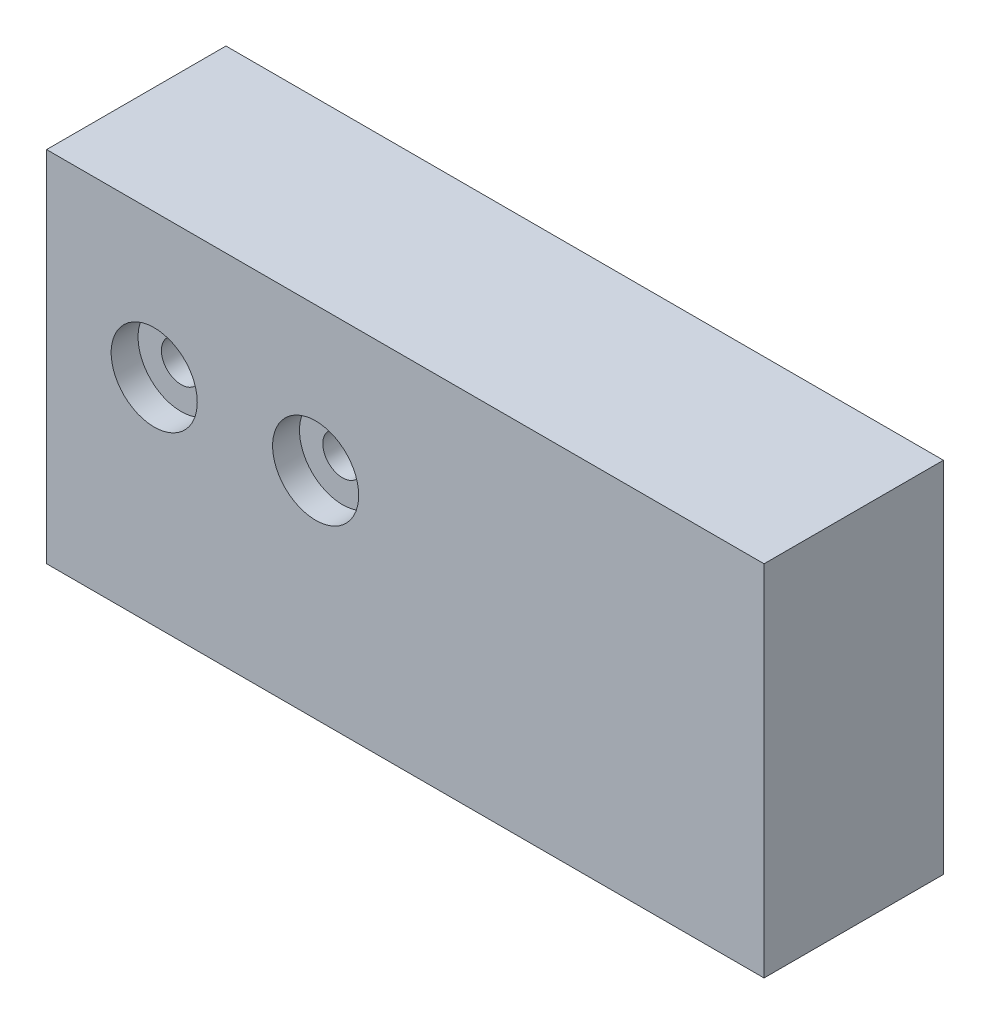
from build123d import *

# Parameters (mm, degrees)
SZKIC1_W                                         = 200
SZKIC1_H                                         = 100
DODANIE_WYCI_GNI_CIE1_DEPTH                      = 50
POG_BIENIE_WALCOWE_POD_M10_RUB_Z_BEM_D           = 11
POG_BIENIE_WALCOWE_POD_M10_RUB_Z_BEM_CBORE_D     = 24
POG_BIENIE_WALCOWE_POD_M10_RUB_Z_BEM_CBORE_DEPTH = 7.5


with BuildPart() as part:
    # Szkic1 → Dodanie-wyci_gni_cie1 (new body)
    with BuildSketch(Plane.XY):
        Rectangle(SZKIC1_W, SZKIC1_H)
    extrude(amount=DODANIE_WYCI_GNI_CIE1_DEPTH)

    # Pog_bienie walcowe pod M10 _rub_ z _bem (through all)
    with Locations(Plane.XY.offset(50)):
        with Locations((-70, 10), (-25, 10)):
            CounterBoreHole(POG_BIENIE_WALCOWE_POD_M10_RUB_Z_BEM_D / 2, POG_BIENIE_WALCOWE_POD_M10_RUB_Z_BEM_CBORE_D / 2, POG_BIENIE_WALCOWE_POD_M10_RUB_Z_BEM_CBORE_DEPTH)


solid = part.part
